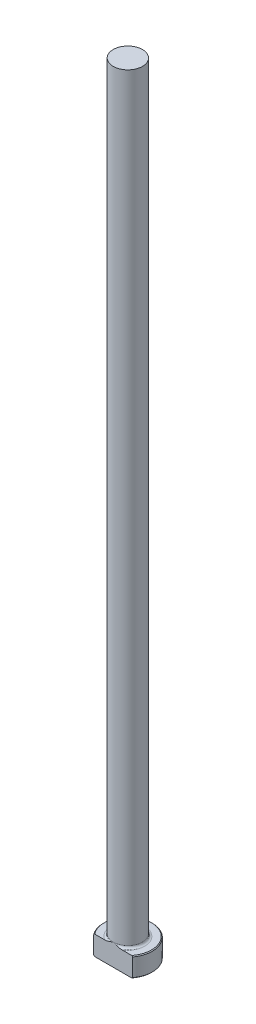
from build123d import *

# Parameters (mm, degrees)
CHAMFER1_SIZE = 0.254
FILLET1_R     = 0.762
KEY_DEPTH     = 255.247925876


with BuildPart() as part:
    # Sketch1 → Revolve1 (revolve)
    with BuildSketch(Plane.XY, mode=Mode.PRIVATE) as revolve1_sk:
        Polygon((0, 0), (-7.9375, 0), (-7.9375, 6.35), (-4.7625, 6.35), (-4.7625, 254), (0, 254), align=None)
    revolve(revolve1_sk.sketch.rotate(Axis((0, 259.958771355, 0), (0, -1, 0)), 270), axis=Axis((0, 259.958771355, 0), (0, -1, 0)))

    # Chamfer1
    chamfer1_edges = [part.edges().sort_by_distance(p)[0] for p in [
        (0, 6.35, -7.9375),
        (0, 0, -7.9375),
    ]]
    chamfer(chamfer1_edges, length=CHAMFER1_SIZE)

    # Fillet1
    fillet1_edges = [part.edges().sort_by_distance(p)[0] for p in [
        (0, 6.35, -4.7625),
    ]]
    fillet(fillet1_edges, radius=FILLET1_R)

    # Sketch2 → Key (cut, through all)
    with BuildSketch(Plane(origin=(0, 0, 0), x_dir=(1, 0, 0), z_dir=(0, 1, 0))):
        with BuildLine():
            Line((-6.35, -4.7625), (6.35, -4.7625))
            ThreePointArc((6.35, -4.7625), (0, -7.9375), (-6.35, -4.7625))
        make_face()
    extrude(amount=KEY_DEPTH, mode=Mode.SUBTRACT)


solid = part.part
